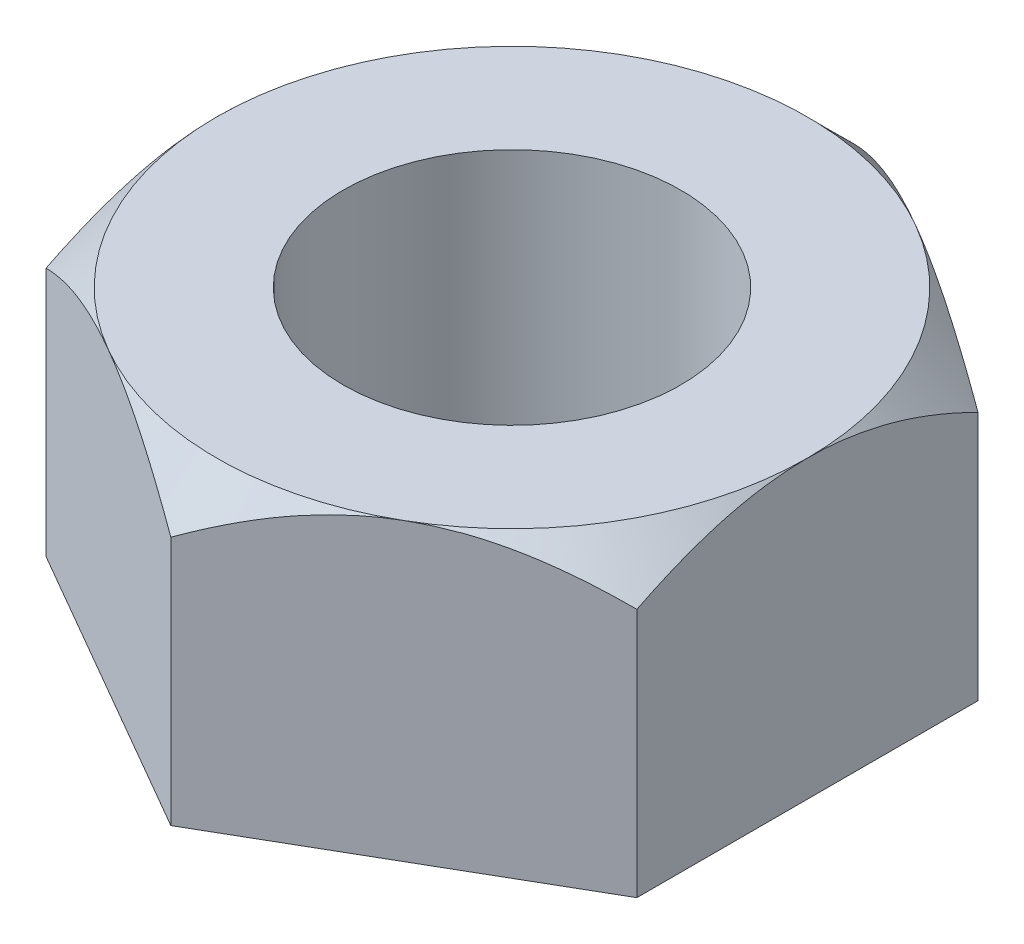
from build123d import *

# Parameters (mm, degrees)
EXTRUDE1_DEPTH     = 5.55625
SKETCH4_R          = 3.175
CUT_EXTRUDE1_DEPTH = 11.1442782


with BuildPart() as part:
    # Sketch1 → Extrude1 (new body)
    with BuildSketch(Plane(origin=(0, 0, 0), x_dir=(1, 0, 0), z_dir=(0, 1, 0))):
        Polygon((0, 6.415804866), (-5.55625, 3.207902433), (-5.55625, -3.207902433), (0, -6.415804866), (5.55625, -3.207902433), (5.55625, 3.207902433), align=None)
    extrude(amount=EXTRUDE1_DEPTH)

    # Sketch3 → Cut-Revolve2 (revolve, cut)
    with BuildSketch(Plane(origin=(0, 0, 0), x_dir=(0, 0, -1), z_dir=(1, 0, 0))):
        Polygon((5.55625, 5.55625), (6.415804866, 4.696695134), (6.415804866, 5.55625), align=None)
    revolve(axis=Axis((0, 0.541995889, 0), (0, -1, 0)), mode=Mode.SUBTRACT)

    # Sketch4 → Cut-Extrude1 (cut, through all)
    with BuildSketch(Plane(origin=(0, 5.55625, 0), x_dir=(1, 0, 0), z_dir=(0, 1, 0))):
        with Locations(Location((0, 0, 0), (0, 0, 270))):
            Circle(SKETCH4_R)
    extrude(amount=-CUT_EXTRUDE1_DEPTH, mode=Mode.SUBTRACT)


solid = part.part
